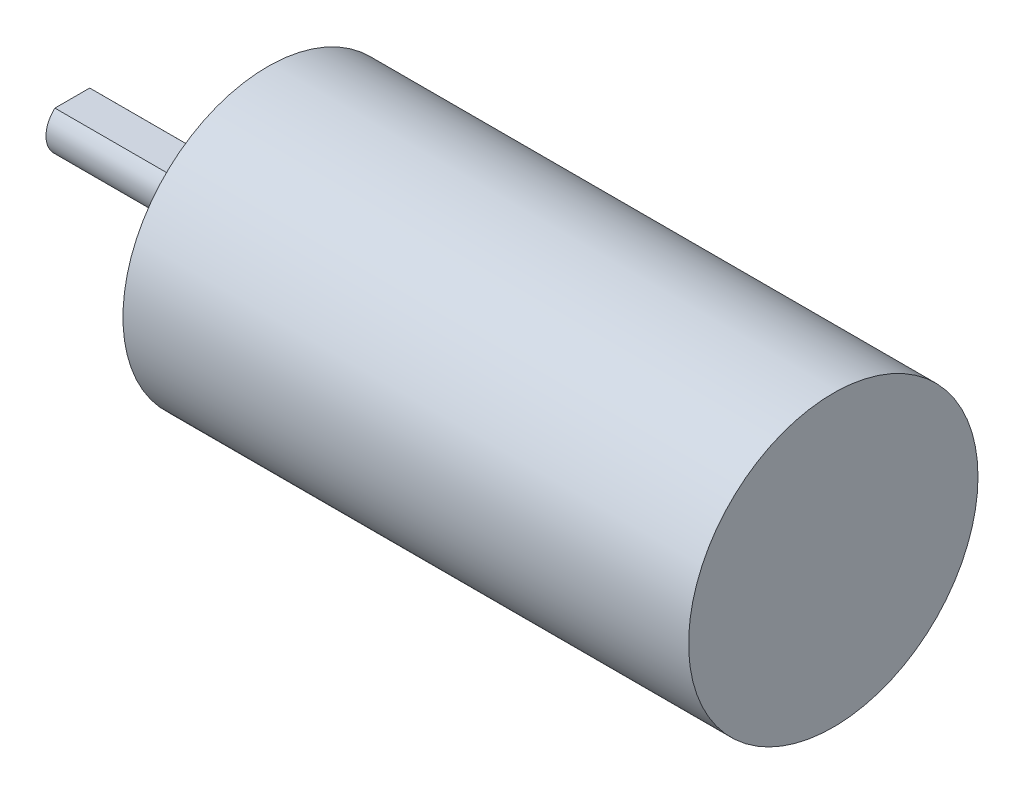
ISO-10303-21;
HEADER;
FILE_DESCRIPTION(('STEP AP214'),'2;1');
FILE_NAME('part.step','',(''),(''),'','','');
FILE_SCHEMA(('AUTOMOTIVE_DESIGN { 1 0 10303 214 1 1 1 1 }'));
ENDSEC;
DATA;
#1=APPLICATION_CONTEXT('core data for automotive mechanical design processes');
#2=APPLICATION_PROTOCOL_DEFINITION('international standard','automotive_design',2000,#1);
#3=PRODUCT_CONTEXT('',#1,'mechanical');
#4=PRODUCT('Part','Part','',(#3));
#5=PRODUCT_RELATED_PRODUCT_CATEGORY('part','',(#4));
#6=PRODUCT_DEFINITION_FORMATION('','',#4);
#7=PRODUCT_DEFINITION_CONTEXT('part definition',#1,'design');
#8=PRODUCT_DEFINITION('design','',#6,#7);
#9=PRODUCT_DEFINITION_SHAPE('','',#8);
#10=(LENGTH_UNIT() NAMED_UNIT(*) SI_UNIT(.MILLI.,.METRE.));
#11=(NAMED_UNIT(*) PLANE_ANGLE_UNIT() SI_UNIT($,.RADIAN.));
#12=(NAMED_UNIT(*) SI_UNIT($,.STERADIAN.) SOLID_ANGLE_UNIT());
#13=UNCERTAINTY_MEASURE_WITH_UNIT(LENGTH_MEASURE(1.E-05),#10,'distance_accuracy_value','');
#14=(GEOMETRIC_REPRESENTATION_CONTEXT(3) GLOBAL_UNCERTAINTY_ASSIGNED_CONTEXT((#13)) GLOBAL_UNIT_ASSIGNED_CONTEXT((#10,
#11,#12)) REPRESENTATION_CONTEXT('',''));
#15=CARTESIAN_POINT('',(0.,0.,0.));
#16=DIRECTION('',(0.,0.,1.));
#17=DIRECTION('',(1.,0.,0.));
#18=AXIS2_PLACEMENT_3D('',#15,#16,#17);
#19=CARTESIAN_POINT('',(-2.5475,0.,0.));
#20=DIRECTION('',(1.,0.,0.));
#21=DIRECTION('',(0.,0.,-1.));
#22=AXIS2_PLACEMENT_3D('',#19,#20,#21);
#23=CYLINDRICAL_SURFACE('',#22,11.);
#24=CARTESIAN_POINT('',(14.85,0.,0.));
#25=DIRECTION('',(1.,0.,0.));
#26=DIRECTION('',(0.,0.,-1.));
#27=AXIS2_PLACEMENT_3D('',#24,#25,#26);
#28=CIRCLE('',#27,11.);
#29=CARTESIAN_POINT('',(14.85,0.,-11.));
#30=VERTEX_POINT('',#29);
#31=EDGE_CURVE('E11',#30,#30,#28,.T.);
#32=ORIENTED_EDGE('',*,*,#31,.T.);
#33=EDGE_LOOP('',(#32));
#34=FACE_BOUND('',#33,.T.);
#35=CARTESIAN_POINT('',(57.85,0.,0.));
#36=DIRECTION('',(1.,0.,0.));
#37=DIRECTION('',(0.,0.,-1.));
#38=AXIS2_PLACEMENT_3D('',#35,#36,#37);
#39=CIRCLE('',#38,11.);
#40=CARTESIAN_POINT('',(57.85,0.,-11.));
#41=VERTEX_POINT('',#40);
#42=EDGE_CURVE('E90',#41,#41,#39,.T.);
#43=ORIENTED_EDGE('',*,*,#42,.F.);
#44=EDGE_LOOP('',(#43));
#45=FACE_BOUND('',#44,.T.);
#46=ADVANCED_FACE('F45',(#34,#45),#23,.T.);
#47=CARTESIAN_POINT('',(9.3,1.5,-7.4623));
#48=DIRECTION('',(0.707106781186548,-0.707106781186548,0.));
#49=DIRECTION('',(0.707106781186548,0.707106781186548,0.));
#50=AXIS2_PLACEMENT_3D('',#47,#48,#49);
#51=PLANE('',#50);
#52=DIRECTION('',(0.,0.,-1.));
#53=VECTOR('',#52,1.);
#54=CARTESIAN_POINT('',(9.3,1.5,-7.4623));
#55=LINE('',#54,#53);
#56=CARTESIAN_POINT('',(9.30000000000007,1.50000000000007,-1.32287565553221));
#57=VERTEX_POINT('',#56);
#58=CARTESIAN_POINT('',(9.30000000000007,1.50000000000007,1.32287565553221));
#59=VERTEX_POINT('',#58);
#60=EDGE_CURVE('E83',#57,#59,#55,.F.);
#61=ORIENTED_EDGE('',*,*,#60,.T.);
#62=CARTESIAN_POINT('',(7.8,0.,0.));
#63=DIRECTION('',(0.707106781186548,-0.707106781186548,0.));
#64=DIRECTION('',(0.707106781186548,0.707106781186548,0.));
#65=AXIS2_PLACEMENT_3D('',#62,#63,#64);
#66=ELLIPSE('',#65,2.82842712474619,2.);
#67=EDGE_CURVE('E49',#57,#59,#66,.T.);
#68=ORIENTED_EDGE('',*,*,#67,.F.);
#69=EDGE_LOOP('',(#61,#68));
#70=FACE_BOUND('',#69,.T.);
#71=ADVANCED_FACE('F47',(#70),#51,.F.);
#72=CARTESIAN_POINT('',(0.,0.,0.));
#73=DIRECTION('',(1.,0.,0.));
#74=DIRECTION('',(0.,0.,-1.));
#75=AXIS2_PLACEMENT_3D('',#72,#73,#74);
#76=PLANE('',#75);
#77=CARTESIAN_POINT('',(0.,0.,0.));
#78=DIRECTION('',(1.,0.,0.));
#79=DIRECTION('',(0.,0.,-1.));
#80=AXIS2_PLACEMENT_3D('',#77,#78,#79);
#81=CIRCLE('',#80,2.);
#82=CARTESIAN_POINT('',(0.,1.50000000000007,1.32287565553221));
#83=VERTEX_POINT('',#82);
#84=CARTESIAN_POINT('',(0.,1.50000000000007,-1.32287565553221));
#85=VERTEX_POINT('',#84);
#86=EDGE_CURVE('E100',#83,#85,#81,.T.);
#87=ORIENTED_EDGE('',*,*,#86,.F.);
#88=DIRECTION('',(0.,0.,-1.));
#89=VECTOR('',#88,1.);
#90=CARTESIAN_POINT('',(0.,1.5,-7.4623));
#91=LINE('',#90,#89);
#92=EDGE_CURVE('E89',#83,#85,#91,.T.);
#93=ORIENTED_EDGE('',*,*,#92,.T.);
#94=EDGE_LOOP('',(#87,#93));
#95=FACE_BOUND('',#94,.T.);
#96=ADVANCED_FACE('F204',(#95),#76,.F.);
#97=CARTESIAN_POINT('',(0.,1.5,-7.4623));
#98=DIRECTION('',(0.,-1.,0.));
#99=DIRECTION('',(0.,0.,-1.));
#100=AXIS2_PLACEMENT_3D('',#97,#98,#99);
#101=PLANE('',#100);
#102=DIRECTION('',(1.,0.,0.));
#103=VECTOR('',#102,1.);
#104=CARTESIAN_POINT('',(-2.5475,1.50000000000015,-1.32287565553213));
#105=LINE('',#104,#103);
#106=EDGE_CURVE('E95',#85,#57,#105,.T.);
#107=ORIENTED_EDGE('',*,*,#106,.F.);
#108=ORIENTED_EDGE('',*,*,#92,.F.);
#109=DIRECTION('',(1.,0.,0.));
#110=VECTOR('',#109,1.);
#111=CARTESIAN_POINT('',(-2.5475,1.50000000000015,1.32287565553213));
#112=LINE('',#111,#110);
#113=EDGE_CURVE('E96',#59,#83,#112,.F.);
#114=ORIENTED_EDGE('',*,*,#113,.F.);
#115=ORIENTED_EDGE('',*,*,#60,.F.);
#116=EDGE_LOOP('',(#107,#108,#114,#115));
#117=FACE_BOUND('',#116,.T.);
#118=ADVANCED_FACE('F93',(#117),#101,.F.);
#119=CARTESIAN_POINT('',(-2.5475,0.,0.));
#120=DIRECTION('',(1.,0.,0.));
#121=DIRECTION('',(0.,0.,-1.));
#122=AXIS2_PLACEMENT_3D('',#119,#120,#121);
#123=CYLINDRICAL_SURFACE('',#122,2.);
#124=CARTESIAN_POINT('',(11.7,0.,0.));
#125=DIRECTION('',(1.,0.,0.));
#126=DIRECTION('',(0.,0.,-1.));
#127=AXIS2_PLACEMENT_3D('',#124,#125,#126);
#128=CIRCLE('',#127,2.);
#129=CARTESIAN_POINT('',(11.7,0.,-2.));
#130=VERTEX_POINT('',#129);
#131=EDGE_CURVE('E141',#130,#130,#128,.F.);
#132=ORIENTED_EDGE('',*,*,#131,.T.);
#133=EDGE_LOOP('',(#132));
#134=FACE_BOUND('',#133,.T.);
#135=ORIENTED_EDGE('',*,*,#67,.T.);
#136=ORIENTED_EDGE('',*,*,#113,.T.);
#137=ORIENTED_EDGE('',*,*,#86,.T.);
#138=ORIENTED_EDGE('',*,*,#106,.T.);
#139=EDGE_LOOP('',(#135,#136,#137,#138));
#140=FACE_BOUND('',#139,.T.);
#141=ADVANCED_FACE('F99',(#134,#140),#123,.T.);
#142=CARTESIAN_POINT('',(11.7,0.,0.));
#143=DIRECTION('',(1.,0.,0.));
#144=DIRECTION('',(0.,0.,-1.));
#145=AXIS2_PLACEMENT_3D('',#142,#143,#144);
#146=PLANE('',#145);
#147=ORIENTED_EDGE('',*,*,#131,.F.);
#148=EDGE_LOOP('',(#147));
#149=FACE_BOUND('',#148,.T.);
#150=CARTESIAN_POINT('',(11.7,0.,0.));
#151=DIRECTION('',(1.,0.,0.));
#152=DIRECTION('',(0.,0.,-1.));
#153=AXIS2_PLACEMENT_3D('',#150,#151,#152);
#154=CIRCLE('',#153,3.5);
#155=CARTESIAN_POINT('',(11.7,0.,-3.5));
#156=VERTEX_POINT('',#155);
#157=EDGE_CURVE('E137',#156,#156,#154,.T.);
#158=ORIENTED_EDGE('',*,*,#157,.F.);
#159=EDGE_LOOP('',(#158));
#160=FACE_BOUND('',#159,.T.);
#161=ADVANCED_FACE('F216',(#149,#160),#146,.F.);
#162=CARTESIAN_POINT('',(-2.5475,0.,0.));
#163=DIRECTION('',(1.,0.,0.));
#164=DIRECTION('',(0.,0.,-1.));
#165=AXIS2_PLACEMENT_3D('',#162,#163,#164);
#166=CYLINDRICAL_SURFACE('',#165,3.5);
#167=CARTESIAN_POINT('',(13.5,0.,0.));
#168=DIRECTION('',(1.,0.,0.));
#169=DIRECTION('',(0.,0.,-1.));
#170=AXIS2_PLACEMENT_3D('',#167,#168,#169);
#171=CIRCLE('',#170,3.5);
#172=CARTESIAN_POINT('',(13.5,0.,-3.5));
#173=VERTEX_POINT('',#172);
#174=EDGE_CURVE('E133',#173,#173,#171,.F.);
#175=ORIENTED_EDGE('',*,*,#174,.T.);
#176=EDGE_LOOP('',(#175));
#177=FACE_BOUND('',#176,.T.);
#178=ORIENTED_EDGE('',*,*,#157,.T.);
#179=EDGE_LOOP('',(#178));
#180=FACE_BOUND('',#179,.T.);
#181=ADVANCED_FACE('F219',(#177,#180),#166,.T.);
#182=CARTESIAN_POINT('',(13.5,0.,0.));
#183=DIRECTION('',(1.,0.,0.));
#184=DIRECTION('',(0.,0.,-1.));
#185=AXIS2_PLACEMENT_3D('',#182,#183,#184);
#186=PLANE('',#185);
#187=ORIENTED_EDGE('',*,*,#174,.F.);
#188=EDGE_LOOP('',(#187));
#189=FACE_BOUND('',#188,.T.);
#190=CARTESIAN_POINT('',(13.5,0.,0.));
#191=DIRECTION('',(1.,0.,0.));
#192=DIRECTION('',(0.,0.,-1.));
#193=AXIS2_PLACEMENT_3D('',#190,#191,#192);
#194=CIRCLE('',#193,5.);
#195=CARTESIAN_POINT('',(13.5,0.,-5.));
#196=VERTEX_POINT('',#195);
#197=EDGE_CURVE('E128',#196,#196,#194,.T.);
#198=ORIENTED_EDGE('',*,*,#197,.F.);
#199=EDGE_LOOP('',(#198));
#200=FACE_BOUND('',#199,.T.);
#201=ADVANCED_FACE('F223',(#189,#200),#186,.F.);
#202=CARTESIAN_POINT('',(20.8500000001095,7.,0.));
#203=DIRECTION('',(-1.,0.,0.));
#204=DIRECTION('',(0.,0.,1.));
#205=AXIS2_PLACEMENT_3D('',#202,#203,#204);
#206=CONICAL_SURFACE('',#205,1.02499999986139,1.02974425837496);
#207=CARTESIAN_POINT('',(20.85,7.,0.));
#208=DIRECTION('',(-1.,0.,0.));
#209=DIRECTION('',(0.,0.,1.));
#210=AXIS2_PLACEMENT_3D('',#207,#208,#209);
#211=CIRCLE('',#210,1.025);
#212=CARTESIAN_POINT('',(20.85,7.,1.025));
#213=VERTEX_POINT('',#212);
#214=EDGE_CURVE('E132',#213,#213,#211,.T.);
#215=ORIENTED_EDGE('',*,*,#214,.T.);
#216=EDGE_LOOP('',(#215));
#217=FACE_BOUND('',#216,.T.);
#218=CARTESIAN_POINT('',(21.4658821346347,7.00000000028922,0.));
#219=VERTEX_POINT('',#218);
#220=VERTEX_LOOP('',#219);
#221=FACE_BOUND('',#220,.T.);
#222=ADVANCED_FACE('F227',(#217,#221),#206,.F.);
#223=CARTESIAN_POINT('',(20.8500000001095,-3.5,-6.062177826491));
#224=DIRECTION('',(-1.,0.,0.));
#225=DIRECTION('',(0.,0.,1.));
#226=AXIS2_PLACEMENT_3D('',#223,#224,#225);
#227=CONICAL_SURFACE('',#226,1.02499999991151,1.02974425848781);
#228=CARTESIAN_POINT('',(20.85,-3.5,-6.062177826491));
#229=DIRECTION('',(-1.,0.,0.));
#230=DIRECTION('',(0.,0.,1.));
#231=AXIS2_PLACEMENT_3D('',#228,#229,#230);
#232=CIRCLE('',#231,1.025);
#233=CARTESIAN_POINT('',(20.85,-3.5,-5.037177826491));
#234=VERTEX_POINT('',#233);
#235=EDGE_CURVE('E165',#234,#234,#232,.T.);
#236=ORIENTED_EDGE('',*,*,#235,.T.);
#237=EDGE_LOOP('',(#236));
#238=FACE_BOUND('',#237,.T.);
#239=CARTESIAN_POINT('',(21.4658821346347,-3.5,-6.062177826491));
#240=VERTEX_POINT('',#239);
#241=VERTEX_LOOP('',#240);
#242=FACE_BOUND('',#241,.T.);
#243=ADVANCED_FACE('F231',(#238,#242),#227,.F.);
#244=CARTESIAN_POINT('',(20.8500000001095,-3.5,6.062177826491));
#245=DIRECTION('',(-1.,0.,0.));
#246=DIRECTION('',(0.,0.,1.));
#247=AXIS2_PLACEMENT_3D('',#244,#245,#246);
#248=CONICAL_SURFACE('',#247,1.02499999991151,1.02974425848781);
#249=CARTESIAN_POINT('',(20.85,-3.5,6.062177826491));
#250=DIRECTION('',(-1.,0.,0.));
#251=DIRECTION('',(0.,0.,1.));
#252=AXIS2_PLACEMENT_3D('',#249,#250,#251);
#253=CIRCLE('',#252,1.025);
#254=CARTESIAN_POINT('',(20.85,-3.5,7.087177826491));
#255=VERTEX_POINT('',#254);
#256=EDGE_CURVE('E127',#255,#255,#253,.T.);
#257=ORIENTED_EDGE('',*,*,#256,.T.);
#258=EDGE_LOOP('',(#257));
#259=FACE_BOUND('',#258,.T.);
#260=CARTESIAN_POINT('',(21.4658821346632,-3.49999999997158,6.06217782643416));
#261=VERTEX_POINT('',#260);
#262=VERTEX_LOOP('',#261);
#263=FACE_BOUND('',#262,.T.);
#264=ADVANCED_FACE('F172',(#259,#263),#248,.F.);
#265=CARTESIAN_POINT('',(-2.5475,0.,0.));
#266=DIRECTION('',(1.,0.,0.));
#267=DIRECTION('',(0.,0.,-1.));
#268=AXIS2_PLACEMENT_3D('',#265,#266,#267);
#269=CYLINDRICAL_SURFACE('',#268,5.);
#270=CARTESIAN_POINT('',(14.85,0.,0.));
#271=DIRECTION('',(1.,0.,0.));
#272=DIRECTION('',(0.,0.,-1.));
#273=AXIS2_PLACEMENT_3D('',#270,#271,#272);
#274=CIRCLE('',#273,5.);
#275=CARTESIAN_POINT('',(14.85,0.,-5.));
#276=VERTEX_POINT('',#275);
#277=EDGE_CURVE('E123',#276,#276,#274,.F.);
#278=ORIENTED_EDGE('',*,*,#277,.T.);
#279=EDGE_LOOP('',(#278));
#280=FACE_BOUND('',#279,.T.);
#281=ORIENTED_EDGE('',*,*,#197,.T.);
#282=EDGE_LOOP('',(#281));
#283=FACE_BOUND('',#282,.T.);
#284=ADVANCED_FACE('F238',(#280,#283),#269,.T.);
#285=CARTESIAN_POINT('',(21.79667624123,7.,0.));
#286=DIRECTION('',(-1.,0.,0.));
#287=DIRECTION('',(0.,0.,1.));
#288=AXIS2_PLACEMENT_3D('',#285,#286,#287);
#289=CYLINDRICAL_SURFACE('',#288,1.025);
#290=ORIENTED_EDGE('',*,*,#214,.F.);
#291=EDGE_LOOP('',(#290));
#292=FACE_BOUND('',#291,.T.);
#293=CARTESIAN_POINT('',(14.85,7.,0.));
#294=DIRECTION('',(-1.,0.,0.));
#295=DIRECTION('',(0.,0.,1.));
#296=AXIS2_PLACEMENT_3D('',#293,#294,#295);
#297=CIRCLE('',#296,1.025);
#298=CARTESIAN_POINT('',(14.85,7.,1.025));
#299=VERTEX_POINT('',#298);
#300=EDGE_CURVE('E119',#299,#299,#297,.T.);
#301=ORIENTED_EDGE('',*,*,#300,.T.);
#302=EDGE_LOOP('',(#301));
#303=FACE_BOUND('',#302,.T.);
#304=ADVANCED_FACE('F241',(#292,#303),#289,.F.);
#305=CARTESIAN_POINT('',(21.79667624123,-3.5,-6.062177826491));
#306=DIRECTION('',(-1.,0.,0.));
#307=DIRECTION('',(0.,0.,1.));
#308=AXIS2_PLACEMENT_3D('',#305,#306,#307);
#309=CYLINDRICAL_SURFACE('',#308,1.025);
#310=ORIENTED_EDGE('',*,*,#235,.F.);
#311=EDGE_LOOP('',(#310));
#312=FACE_BOUND('',#311,.T.);
#313=CARTESIAN_POINT('',(14.85,-3.5,-6.062177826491));
#314=DIRECTION('',(-1.,0.,0.));
#315=DIRECTION('',(0.,0.,1.));
#316=AXIS2_PLACEMENT_3D('',#313,#314,#315);
#317=CIRCLE('',#316,1.025);
#318=CARTESIAN_POINT('',(14.85,-3.5,-5.037177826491));
#319=VERTEX_POINT('',#318);
#320=EDGE_CURVE('E115',#319,#319,#317,.T.);
#321=ORIENTED_EDGE('',*,*,#320,.T.);
#322=EDGE_LOOP('',(#321));
#323=FACE_BOUND('',#322,.T.);
#324=ADVANCED_FACE('F178',(#312,#323),#309,.F.);
#325=CARTESIAN_POINT('',(21.79667624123,-3.5,6.062177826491));
#326=DIRECTION('',(-1.,0.,0.));
#327=DIRECTION('',(0.,0.,1.));
#328=AXIS2_PLACEMENT_3D('',#325,#326,#327);
#329=CYLINDRICAL_SURFACE('',#328,1.025);
#330=ORIENTED_EDGE('',*,*,#256,.F.);
#331=EDGE_LOOP('',(#330));
#332=FACE_BOUND('',#331,.T.);
#333=CARTESIAN_POINT('',(14.85,-3.5,6.062177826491));
#334=DIRECTION('',(-1.,0.,0.));
#335=DIRECTION('',(0.,0.,1.));
#336=AXIS2_PLACEMENT_3D('',#333,#334,#335);
#337=CIRCLE('',#336,1.025);
#338=CARTESIAN_POINT('',(14.85,-3.5,7.087177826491));
#339=VERTEX_POINT('',#338);
#340=EDGE_CURVE('E56',#339,#339,#337,.T.);
#341=ORIENTED_EDGE('',*,*,#340,.T.);
#342=EDGE_LOOP('',(#341));
#343=FACE_BOUND('',#342,.T.);
#344=ADVANCED_FACE('F174',(#332,#343),#329,.F.);
#345=CARTESIAN_POINT('',(14.85,0.,0.));
#346=DIRECTION('',(1.,0.,0.));
#347=DIRECTION('',(0.,0.,-1.));
#348=AXIS2_PLACEMENT_3D('',#345,#346,#347);
#349=PLANE('',#348);
#350=ORIENTED_EDGE('',*,*,#340,.F.);
#351=EDGE_LOOP('',(#350));
#352=FACE_BOUND('',#351,.T.);
#353=ORIENTED_EDGE('',*,*,#320,.F.);
#354=EDGE_LOOP('',(#353));
#355=FACE_BOUND('',#354,.T.);
#356=ORIENTED_EDGE('',*,*,#300,.F.);
#357=EDGE_LOOP('',(#356));
#358=FACE_BOUND('',#357,.T.);
#359=ORIENTED_EDGE('',*,*,#277,.F.);
#360=EDGE_LOOP('',(#359));
#361=FACE_BOUND('',#360,.T.);
#362=ORIENTED_EDGE('',*,*,#31,.F.);
#363=EDGE_LOOP('',(#362));
#364=FACE_BOUND('',#363,.T.);
#365=ADVANCED_FACE('F177',(#352,#355,#358,#361,#364),#349,.F.);
#366=CARTESIAN_POINT('',(57.85,0.,0.));
#367=DIRECTION('',(1.,0.,0.));
#368=DIRECTION('',(0.,0.,-1.));
#369=AXIS2_PLACEMENT_3D('',#366,#367,#368);
#370=PLANE('',#369);
#371=ORIENTED_EDGE('',*,*,#42,.T.);
#372=EDGE_LOOP('',(#371));
#373=FACE_BOUND('',#372,.T.);
#374=ADVANCED_FACE('F184',(#373),#370,.T.);
#375=CLOSED_SHELL('',(#46,#71,#96,#118,#141,#161,#181,#201,#222,#243,#264,#284,#304,#324,#344,
#365,#374));
#376=MANIFOLD_SOLID_BREP('B2',#375);
#377=ADVANCED_BREP_SHAPE_REPRESENTATION('',(#18,#376),#14);
#378=SHAPE_DEFINITION_REPRESENTATION(#9,#377);
ENDSEC;
END-ISO-10303-21;
